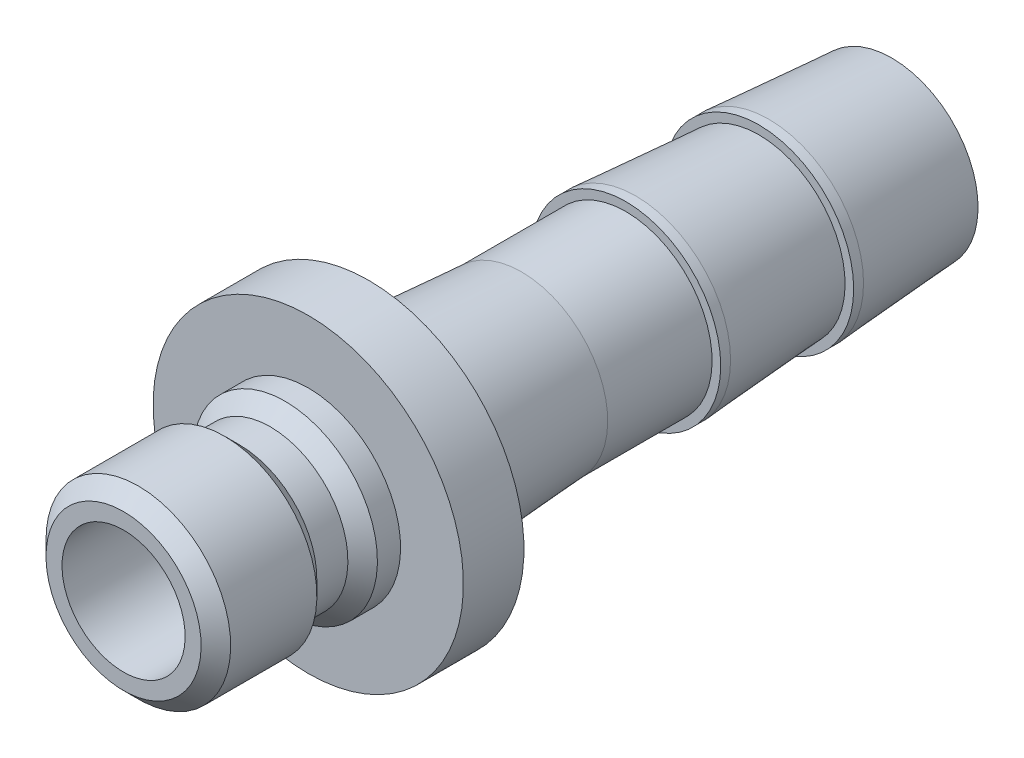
from build123d import *


with BuildPart() as part:
    # Sketch1 → Revolve1 (revolve)
    with BuildSketch(Plane(origin=(0, 0, 0), x_dir=(0, 0, -1), z_dir=(1, 0, 0))):
        Polygon((-9.525, 3.175), (-9.525, 4.0005), (-8.763, 4.7625), (-4.318, 4.7625), (-3.556, 4.0005), (-1.9558, 4.0005), (-1.1938, 4.7625), (0, 4.7625), (0, 8.001), (3.1242, 8.001), (3.1242, 4.8895), (4.6482, 4.8895), (10.9982, 4.445), (16.383, 4.445), (16.383, 4.8895), (16.891, 4.8895), (23.241, 4.445), (23.241, 4.8895), (23.749, 4.8895), (30.099, 4.445), (30.099, 3.175), align=None)
    revolve(axis=Axis((0, 0, 0), (0, 0, 1)))


solid = part.part
